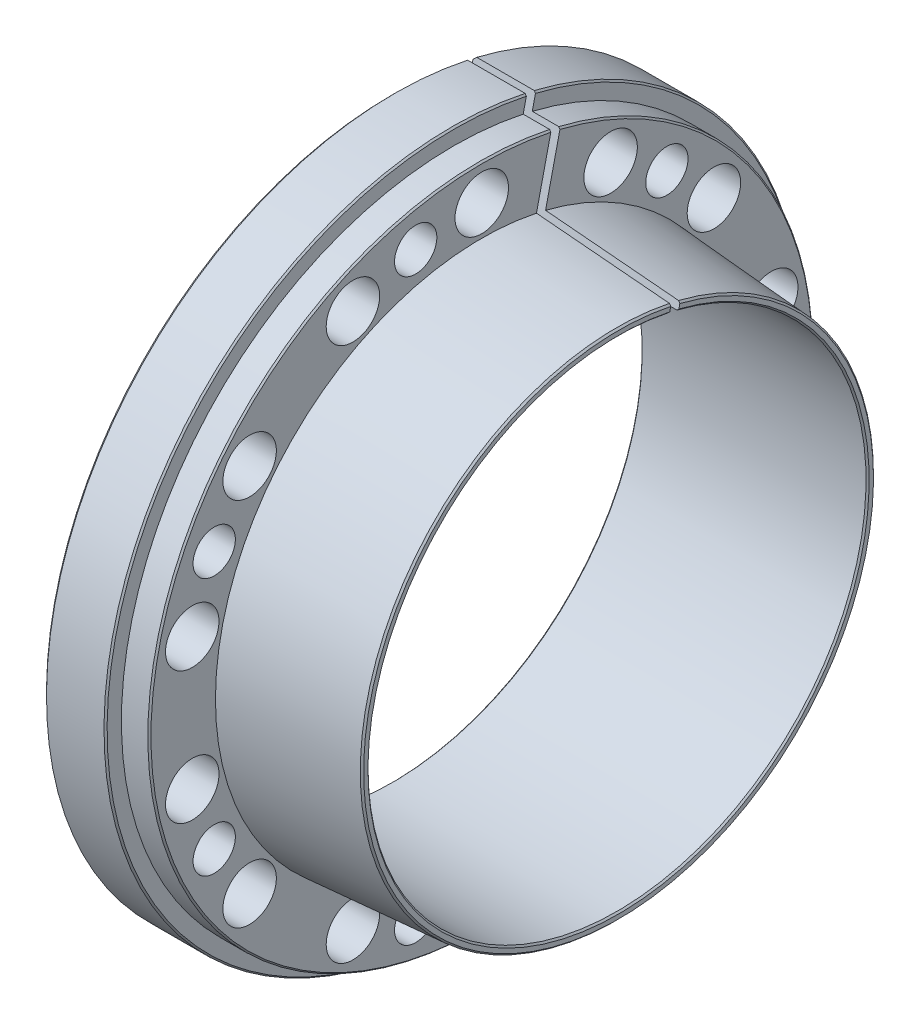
ISO-10303-21;
HEADER;
FILE_DESCRIPTION(('STEP AP214'),'2;1');
FILE_NAME('part.step','',(''),(''),'','','');
FILE_SCHEMA(('AUTOMOTIVE_DESIGN { 1 0 10303 214 1 1 1 1 }'));
ENDSEC;
DATA;
#1=APPLICATION_CONTEXT('core data for automotive mechanical design processes');
#2=APPLICATION_PROTOCOL_DEFINITION('international standard','automotive_design',2000,#1);
#3=PRODUCT_CONTEXT('',#1,'mechanical');
#4=PRODUCT('Part','Part','',(#3));
#5=PRODUCT_RELATED_PRODUCT_CATEGORY('part','',(#4));
#6=PRODUCT_DEFINITION_FORMATION('','',#4);
#7=PRODUCT_DEFINITION_CONTEXT('part definition',#1,'design');
#8=PRODUCT_DEFINITION('design','',#6,#7);
#9=PRODUCT_DEFINITION_SHAPE('','',#8);
#10=(LENGTH_UNIT() NAMED_UNIT(*) SI_UNIT(.MILLI.,.METRE.));
#11=(NAMED_UNIT(*) PLANE_ANGLE_UNIT() SI_UNIT($,.RADIAN.));
#12=(NAMED_UNIT(*) SI_UNIT($,.STERADIAN.) SOLID_ANGLE_UNIT());
#13=UNCERTAINTY_MEASURE_WITH_UNIT(LENGTH_MEASURE(1.E-05),#10,'distance_accuracy_value','');
#14=(GEOMETRIC_REPRESENTATION_CONTEXT(3) GLOBAL_UNCERTAINTY_ASSIGNED_CONTEXT((#13)) GLOBAL_UNIT_ASSIGNED_CONTEXT((#10,
#11,#12)) REPRESENTATION_CONTEXT('',''));
#15=CARTESIAN_POINT('',(0.,0.,0.));
#16=DIRECTION('',(0.,0.,1.));
#17=DIRECTION('',(1.,0.,0.));
#18=AXIS2_PLACEMENT_3D('',#15,#16,#17);
#19=CARTESIAN_POINT('',(0.,0.,0.));
#20=DIRECTION('',(-1.,0.,0.));
#21=DIRECTION('',(0.,0.,1.));
#22=AXIS2_PLACEMENT_3D('',#19,#20,#21);
#23=CYLINDRICAL_SURFACE('',#22,56.);
#24=CARTESIAN_POINT('',(9.75000000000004,0.,0.));
#25=DIRECTION('',(-1.,0.,0.));
#26=DIRECTION('',(0.,0.,1.));
#27=AXIS2_PLACEMENT_3D('',#24,#25,#26);
#28=CIRCLE('',#27,56.);
#29=CARTESIAN_POINT('',(9.75000000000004,54.4241856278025,-13.1912099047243));
#30=VERTEX_POINT('',#29);
#31=CARTESIAN_POINT('',(9.75000000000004,54.7579659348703,-11.7288177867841));
#32=VERTEX_POINT('',#31);
#33=EDGE_CURVE('E169',#30,#32,#28,.T.);
#34=ORIENTED_EDGE('',*,*,#33,.T.);
#35=DIRECTION('',(-1.,0.,0.));
#36=VECTOR('',#35,1.);
#37=CARTESIAN_POINT('',(0.,54.7579659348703,-11.7288177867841));
#38=LINE('',#37,#36);
#39=CARTESIAN_POINT('',(0.499999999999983,54.7579659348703,-11.7288177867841));
#40=VERTEX_POINT('',#39);
#41=EDGE_CURVE('E546',#32,#40,#38,.T.);
#42=ORIENTED_EDGE('',*,*,#41,.T.);
#43=CARTESIAN_POINT('',(0.49999999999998,0.,0.));
#44=DIRECTION('',(1.,0.,0.));
#45=DIRECTION('',(0.,0.,-1.));
#46=AXIS2_PLACEMENT_3D('',#43,#44,#45);
#47=CIRCLE('',#46,56.);
#48=CARTESIAN_POINT('',(0.49999999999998,54.4241856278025,-13.1912099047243));
#49=VERTEX_POINT('',#48);
#50=EDGE_CURVE('E184',#40,#49,#47,.T.);
#51=ORIENTED_EDGE('',*,*,#50,.T.);
#52=DIRECTION('',(-1.,0.,0.));
#53=VECTOR('',#52,1.);
#54=CARTESIAN_POINT('',(0.,54.4241856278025,-13.1912099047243));
#55=LINE('',#54,#53);
#56=EDGE_CURVE('E65',#30,#49,#55,.T.);
#57=ORIENTED_EDGE('',*,*,#56,.F.);
#58=EDGE_LOOP('',(#34,#42,#51,#57));
#59=FACE_BOUND('',#58,.T.);
#60=ADVANCED_FACE('F39',(#59),#23,.T.);
#61=CARTESIAN_POINT('',(0.,40.05,0.));
#62=DIRECTION('',(1.,0.,0.));
#63=DIRECTION('',(0.,0.,-1.));
#64=AXIS2_PLACEMENT_3D('',#61,#62,#63);
#65=PLANE('',#64);
#66=CARTESIAN_POINT('',(0.,46.5528157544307,10.6253397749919));
#67=DIRECTION('',(-1.,0.,0.));
#68=DIRECTION('',(0.,0.,1.));
#69=AXIS2_PLACEMENT_3D('',#66,#67,#68);
#70=CIRCLE('',#69,3.39999999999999);
#71=CARTESIAN_POINT('',(0.,46.5528157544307,14.0253397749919));
#72=VERTEX_POINT('',#71);
#73=EDGE_CURVE('E232',#72,#72,#70,.T.);
#74=ORIENTED_EDGE('',*,*,#73,.F.);
#75=EDGE_LOOP('',(#74));
#76=FACE_BOUND('',#75,.T.);
#77=CARTESIAN_POINT('',(0.,29.7716380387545,-37.3324532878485));
#78=DIRECTION('',(-1.,0.,0.));
#79=DIRECTION('',(0.,0.781831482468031,0.623489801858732));
#80=AXIS2_PLACEMENT_3D('',#77,#78,#79);
#81=CIRCLE('',#80,4.3);
#82=CARTESIAN_POINT('',(0.,33.133513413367,-34.6514471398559));
#83=VERTEX_POINT('',#82);
#84=EDGE_CURVE('E857',#83,#83,#81,.T.);
#85=ORIENTED_EDGE('',*,*,#84,.F.);
#86=EDGE_LOOP('',(#85));
#87=FACE_BOUND('',#86,.T.);
#88=CARTESIAN_POINT('',(0.,10.6253745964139,-46.5528078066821));
#89=DIRECTION('',(-1.,0.,0.));
#90=DIRECTION('',(0.,0.974927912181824,0.222520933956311));
#91=AXIS2_PLACEMENT_3D('',#88,#89,#90);
#92=CIRCLE('',#91,4.3);
#93=CARTESIAN_POINT('',(0.,14.8175646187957,-45.59596779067));
#94=VERTEX_POINT('',#93);
#95=EDGE_CURVE('E860',#94,#94,#92,.T.);
#96=ORIENTED_EDGE('',*,*,#95,.F.);
#97=EDGE_LOOP('',(#96));
#98=FACE_BOUND('',#97,.T.);
#99=CARTESIAN_POINT('',(0.,-10.6253745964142,-46.552807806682));
#100=DIRECTION('',(-1.,0.,0.));
#101=DIRECTION('',(0.,0.974927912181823,-0.222520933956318));
#102=AXIS2_PLACEMENT_3D('',#99,#100,#101);
#103=CIRCLE('',#102,4.3);
#104=CARTESIAN_POINT('',(0.,-6.43318457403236,-47.5096478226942));
#105=VERTEX_POINT('',#104);
#106=EDGE_CURVE('E863',#105,#105,#103,.T.);
#107=ORIENTED_EDGE('',*,*,#106,.F.);
#108=EDGE_LOOP('',(#107));
#109=FACE_BOUND('',#108,.T.);
#110=CARTESIAN_POINT('',(0.,-29.7716380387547,-37.3324532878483));
#111=DIRECTION('',(-1.,0.,0.));
#112=DIRECTION('',(0.,0.781831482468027,-0.623489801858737));
#113=AXIS2_PLACEMENT_3D('',#110,#111,#112);
#114=CIRCLE('',#113,4.3);
#115=CARTESIAN_POINT('',(0.,-26.4097626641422,-40.0134594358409));
#116=VERTEX_POINT('',#115);
#117=EDGE_CURVE('E866',#116,#116,#114,.T.);
#118=ORIENTED_EDGE('',*,*,#117,.F.);
#119=EDGE_LOOP('',(#118));
#120=FACE_BOUND('',#119,.T.);
#121=CARTESIAN_POINT('',(0.,-43.0212634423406,-20.7179485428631));
#122=DIRECTION('',(-1.,0.,0.));
#123=DIRECTION('',(0.,0.433883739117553,-0.900968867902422));
#124=AXIS2_PLACEMENT_3D('',#121,#122,#123);
#125=CIRCLE('',#124,4.3);
#126=CARTESIAN_POINT('',(0.,-41.1555633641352,-24.5921146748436));
#127=VERTEX_POINT('',#126);
#128=EDGE_CURVE('E869',#127,#127,#125,.T.);
#129=ORIENTED_EDGE('',*,*,#128,.F.);
#130=EDGE_LOOP('',(#129));
#131=FACE_BOUND('',#130,.T.);
#132=CARTESIAN_POINT('',(0.,-47.75,0.));
#133=DIRECTION('',(-1.,0.,0.));
#134=DIRECTION('',(0.,0.,-1.));
#135=AXIS2_PLACEMENT_3D('',#132,#133,#134);
#136=CIRCLE('',#135,4.3);
#137=CARTESIAN_POINT('',(0.,-47.75,-4.3));
#138=VERTEX_POINT('',#137);
#139=EDGE_CURVE('E872',#138,#138,#136,.T.);
#140=ORIENTED_EDGE('',*,*,#139,.F.);
#141=EDGE_LOOP('',(#140));
#142=FACE_BOUND('',#141,.T.);
#143=CARTESIAN_POINT('',(0.,-43.0212634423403,20.7179485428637));
#144=DIRECTION('',(-1.,0.,0.));
#145=DIRECTION('',(0.,-0.433883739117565,-0.900968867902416));
#146=AXIS2_PLACEMENT_3D('',#143,#144,#145);
#147=CIRCLE('',#146,4.3);
#148=CARTESIAN_POINT('',(0.,-44.8869635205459,16.8437824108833));
#149=VERTEX_POINT('',#148);
#150=EDGE_CURVE('E875',#149,#149,#147,.T.);
#151=ORIENTED_EDGE('',*,*,#150,.F.);
#152=EDGE_LOOP('',(#151));
#153=FACE_BOUND('',#152,.T.);
#154=CARTESIAN_POINT('',(0.,-29.7716380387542,37.3324532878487));
#155=DIRECTION('',(-1.,0.,0.));
#156=DIRECTION('',(0.,-0.781831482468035,-0.623489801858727));
#157=AXIS2_PLACEMENT_3D('',#154,#155,#156);
#158=CIRCLE('',#157,4.3);
#159=CARTESIAN_POINT('',(0.,-33.1335134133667,34.6514471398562));
#160=VERTEX_POINT('',#159);
#161=EDGE_CURVE('E878',#160,#160,#158,.T.);
#162=ORIENTED_EDGE('',*,*,#161,.F.);
#163=EDGE_LOOP('',(#162));
#164=FACE_BOUND('',#163,.T.);
#165=CARTESIAN_POINT('',(0.,-10.6253745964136,46.5528078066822));
#166=DIRECTION('',(-1.,0.,0.));
#167=DIRECTION('',(0.,-0.974927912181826,-0.222520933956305));
#168=AXIS2_PLACEMENT_3D('',#165,#166,#167);
#169=CIRCLE('',#168,4.3);
#170=CARTESIAN_POINT('',(0.,-14.8175646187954,45.5959677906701));
#171=VERTEX_POINT('',#170);
#172=EDGE_CURVE('E880',#171,#171,#169,.T.);
#173=ORIENTED_EDGE('',*,*,#172,.F.);
#174=EDGE_LOOP('',(#173));
#175=FACE_BOUND('',#174,.T.);
#176=CARTESIAN_POINT('',(0.,10.6253745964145,46.552807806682));
#177=DIRECTION('',(-1.,0.,0.));
#178=DIRECTION('',(0.,-0.974927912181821,0.222520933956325));
#179=AXIS2_PLACEMENT_3D('',#176,#177,#178);
#180=CIRCLE('',#179,4.3);
#181=CARTESIAN_POINT('',(0.,6.43318457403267,47.5096478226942));
#182=VERTEX_POINT('',#181);
#183=EDGE_CURVE('E853',#182,#182,#180,.T.);
#184=ORIENTED_EDGE('',*,*,#183,.F.);
#185=EDGE_LOOP('',(#184));
#186=FACE_BOUND('',#185,.T.);
#187=CARTESIAN_POINT('',(0.,29.771638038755,37.3324532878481));
#188=DIRECTION('',(-1.,0.,0.));
#189=DIRECTION('',(0.,-0.781831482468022,0.623489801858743));
#190=AXIS2_PLACEMENT_3D('',#187,#188,#189);
#191=CIRCLE('',#190,4.3);
#192=CARTESIAN_POINT('',(0.,26.4097626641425,40.0134594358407));
#193=VERTEX_POINT('',#192);
#194=EDGE_CURVE('E850',#193,#193,#191,.T.);
#195=ORIENTED_EDGE('',*,*,#194,.F.);
#196=EDGE_LOOP('',(#195));
#197=FACE_BOUND('',#196,.T.);
#198=CARTESIAN_POINT('',(0.,43.0212634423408,20.7179485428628));
#199=DIRECTION('',(-1.,0.,0.));
#200=DIRECTION('',(0.,-0.433883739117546,0.900968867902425));
#201=AXIS2_PLACEMENT_3D('',#198,#199,#200);
#202=CIRCLE('',#201,4.3);
#203=CARTESIAN_POINT('',(0.,41.1555633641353,24.5921146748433));
#204=VERTEX_POINT('',#203);
#205=EDGE_CURVE('E231',#204,#204,#202,.T.);
#206=ORIENTED_EDGE('',*,*,#205,.F.);
#207=EDGE_LOOP('',(#206));
#208=FACE_BOUND('',#207,.T.);
#209=CARTESIAN_POINT('',(0.,43.0212634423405,-20.7179485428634));
#210=DIRECTION('',(-1.,0.,0.));
#211=DIRECTION('',(0.,0.433883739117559,0.900968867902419));
#212=AXIS2_PLACEMENT_3D('',#209,#210,#211);
#213=CIRCLE('',#212,4.3);
#214=CARTESIAN_POINT('',(0.,44.886963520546,-16.843782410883));
#215=VERTEX_POINT('',#214);
#216=EDGE_CURVE('E192',#215,#215,#213,.T.);
#217=ORIENTED_EDGE('',*,*,#216,.F.);
#218=EDGE_LOOP('',(#217));
#219=FACE_BOUND('',#218,.T.);
#220=CARTESIAN_POINT('',(0.,47.75,0.));
#221=DIRECTION('',(-1.,0.,0.));
#222=DIRECTION('',(0.,0.,1.));
#223=AXIS2_PLACEMENT_3D('',#220,#221,#222);
#224=CIRCLE('',#223,4.3);
#225=CARTESIAN_POINT('',(0.,47.75,4.3));
#226=VERTEX_POINT('',#225);
#227=EDGE_CURVE('E155',#226,#226,#224,.T.);
#228=ORIENTED_EDGE('',*,*,#227,.F.);
#229=EDGE_LOOP('',(#228));
#230=FACE_BOUND('',#229,.T.);
#231=CARTESIAN_POINT('',(0.,0.,0.));
#232=DIRECTION('',(1.,0.,0.));
#233=DIRECTION('',(0.,0.,-1.));
#234=AXIS2_PLACEMENT_3D('',#231,#232,#233);
#235=CIRCLE('',#234,55.5);
#236=CARTESIAN_POINT('',(0.,53.936677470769,-13.0799397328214));
#237=VERTEX_POINT('',#236);
#238=CARTESIAN_POINT('',(0.,54.2704577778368,-11.6175476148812));
#239=VERTEX_POINT('',#238);
#240=EDGE_CURVE('E186',#237,#239,#235,.F.);
#241=ORIENTED_EDGE('',*,*,#240,.T.);
#242=DIRECTION('',(0.,-0.97492807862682,0.22252020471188));
#243=VECTOR('',#242,1.);
#244=CARTESIAN_POINT('',(0.,0.16689015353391,0.731196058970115));
#245=LINE('',#244,#243);
#246=CARTESIAN_POINT('',(0.,39.4496871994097,-8.23481510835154));
#247=VERTEX_POINT('',#246);
#248=EDGE_CURVE('E45',#247,#239,#245,.F.);
#249=ORIENTED_EDGE('',*,*,#248,.F.);
#250=CARTESIAN_POINT('',(0.,0.,0.));
#251=DIRECTION('',(1.,0.,0.));
#252=DIRECTION('',(0.,0.,-1.));
#253=AXIS2_PLACEMENT_3D('',#250,#251,#252);
#254=CIRCLE('',#253,40.3);
#255=CARTESIAN_POINT('',(0.,39.1159068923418,-9.69720722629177));
#256=VERTEX_POINT('',#255);
#257=EDGE_CURVE('E183',#247,#256,#254,.T.);
#258=ORIENTED_EDGE('',*,*,#257,.T.);
#259=DIRECTION('',(0.,-0.97492807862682,0.22252020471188));
#260=VECTOR('',#259,1.);
#261=CARTESIAN_POINT('',(0.,53.936677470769,-13.0799397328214));
#262=LINE('',#261,#260);
#263=EDGE_CURVE('E421',#256,#237,#262,.F.);
#264=ORIENTED_EDGE('',*,*,#263,.T.);
#265=EDGE_LOOP('',(#241,#249,#258,#264));
#266=FACE_BOUND('',#265,.T.);
#267=CARTESIAN_POINT('',(0.,37.3324681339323,-29.7716194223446));
#268=DIRECTION('',(-1.,0.,0.));
#269=DIRECTION('',(0.,0.,1.));
#270=AXIS2_PLACEMENT_3D('',#267,#268,#269);
#271=CIRCLE('',#270,3.39999999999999);
#272=CARTESIAN_POINT('',(0.,37.3324681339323,-26.3716194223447));
#273=VERTEX_POINT('',#272);
#274=EDGE_CURVE('E236',#273,#273,#271,.T.);
#275=ORIENTED_EDGE('',*,*,#274,.F.);
#276=EDGE_LOOP('',(#275));
#277=FACE_BOUND('',#276,.T.);
#278=CARTESIAN_POINT('',(0.,8.33394712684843E-05,-47.7499999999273));
#279=DIRECTION('',(-1.,0.,0.));
#280=DIRECTION('',(0.,0.,1.));
#281=AXIS2_PLACEMENT_3D('',#278,#279,#280);
#282=CIRCLE('',#281,3.4);
#283=CARTESIAN_POINT('',(0.,8.33394712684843E-05,-44.3499999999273));
#284=VERTEX_POINT('',#283);
#285=EDGE_CURVE('E240',#284,#284,#282,.T.);
#286=ORIENTED_EDGE('',*,*,#285,.F.);
#287=EDGE_LOOP('',(#286));
#288=FACE_BOUND('',#287,.T.);
#289=CARTESIAN_POINT('',(0.,-37.332364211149,-29.7717497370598));
#290=DIRECTION('',(-1.,0.,0.));
#291=DIRECTION('',(0.,0.,1.));
#292=AXIS2_PLACEMENT_3D('',#289,#290,#291);
#293=CIRCLE('',#292,3.39999999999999);
#294=CARTESIAN_POINT('',(0.,-37.332364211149,-26.3717497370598));
#295=VERTEX_POINT('',#294);
#296=EDGE_CURVE('E244',#295,#295,#293,.T.);
#297=ORIENTED_EDGE('',*,*,#296,.F.);
#298=EDGE_LOOP('',(#297));
#299=FACE_BOUND('',#298,.T.);
#300=CARTESIAN_POINT('',(0.,-46.5528528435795,10.625177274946));
#301=DIRECTION('',(-1.,0.,0.));
#302=DIRECTION('',(0.,0.,1.));
#303=AXIS2_PLACEMENT_3D('',#300,#301,#302);
#304=CIRCLE('',#303,3.39999999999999);
#305=CARTESIAN_POINT('',(0.,-46.5528528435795,14.025177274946));
#306=VERTEX_POINT('',#305);
#307=EDGE_CURVE('E248',#306,#306,#304,.T.);
#308=ORIENTED_EDGE('',*,*,#307,.F.);
#309=EDGE_LOOP('',(#308));
#310=FACE_BOUND('',#309,.T.);
#311=CARTESIAN_POINT('',(0.,-20.7181845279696,43.0211497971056));
#312=DIRECTION('',(-1.,0.,0.));
#313=DIRECTION('',(0.,0.,1.));
#314=AXIS2_PLACEMENT_3D('',#311,#312,#313);
#315=CIRCLE('',#314,3.4);
#316=CARTESIAN_POINT('',(0.,-20.7181845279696,46.4211497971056));
#317=VERTEX_POINT('',#316);
#318=EDGE_CURVE('E904',#317,#317,#315,.T.);
#319=ORIENTED_EDGE('',*,*,#318,.F.);
#320=EDGE_LOOP('',(#319));
#321=FACE_BOUND('',#320,.T.);
#322=CARTESIAN_POINT('',(0.,20.7176589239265,43.0214029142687));
#323=DIRECTION('',(-1.,0.,0.));
#324=DIRECTION('',(0.,0.,1.));
#325=AXIS2_PLACEMENT_3D('',#322,#323,#324);
#326=CIRCLE('',#325,3.4);
#327=CARTESIAN_POINT('',(0.,20.7176589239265,46.4214029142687));
#328=VERTEX_POINT('',#327);
#329=EDGE_CURVE('E339',#328,#328,#326,.T.);
#330=ORIENTED_EDGE('',*,*,#329,.F.);
#331=EDGE_LOOP('',(#330));
#332=FACE_BOUND('',#331,.T.);
#333=ADVANCED_FACE('F430',(#76,#87,#98,#109,#120,#131,#142,#153,#164,#175,#186,#197,#208,#219,
#230,#266,#277,#288,#299,#310,#321,#332),#65,.F.);
#334=CARTESIAN_POINT('',(10.,56.,0.));
#335=DIRECTION('',(-1.,0.,0.));
#336=DIRECTION('',(0.,0.,1.));
#337=AXIS2_PLACEMENT_3D('',#334,#335,#336);
#338=PLANE('',#337);
#339=CARTESIAN_POINT('',(10.,0.,0.));
#340=DIRECTION('',(-1.,0.,0.));
#341=DIRECTION('',(0.,0.,1.));
#342=AXIS2_PLACEMENT_3D('',#339,#340,#341);
#343=CIRCLE('',#342,53.45);
#344=CARTESIAN_POINT('',(10.,51.9378853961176,-12.6237300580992));
#345=VERTEX_POINT('',#344);
#346=CARTESIAN_POINT('',(10.,52.2716657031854,-11.1613379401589));
#347=VERTEX_POINT('',#346);
#348=EDGE_CURVE('E148',#345,#347,#343,.T.);
#349=ORIENTED_EDGE('',*,*,#348,.T.);
#350=DIRECTION('',(0.,0.97492807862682,-0.22252020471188));
#351=VECTOR('',#350,1.);
#352=CARTESIAN_POINT('',(10.,53.394036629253,-11.4175108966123));
#353=LINE('',#352,#351);
#354=CARTESIAN_POINT('',(10.,54.5142119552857,-11.6731827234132));
#355=VERTEX_POINT('',#354);
#356=EDGE_CURVE('E379',#347,#355,#353,.T.);
#357=ORIENTED_EDGE('',*,*,#356,.T.);
#358=CARTESIAN_POINT('',(10.,0.,0.));
#359=DIRECTION('',(-1.,0.,0.));
#360=DIRECTION('',(0.,0.,1.));
#361=AXIS2_PLACEMENT_3D('',#358,#359,#360);
#362=CIRCLE('',#361,55.75);
#363=CARTESIAN_POINT('',(10.,54.1804316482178,-13.1355748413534));
#364=VERTEX_POINT('',#363);
#365=EDGE_CURVE('E172',#355,#364,#362,.F.);
#366=ORIENTED_EDGE('',*,*,#365,.T.);
#367=DIRECTION('',(0.,0.97492807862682,-0.22252020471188));
#368=VECTOR('',#367,1.);
#369=CARTESIAN_POINT('',(10.,53.0602563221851,-12.8799030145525));
#370=LINE('',#369,#368);
#371=EDGE_CURVE('E405',#345,#364,#370,.T.);
#372=ORIENTED_EDGE('',*,*,#371,.F.);
#373=EDGE_LOOP('',(#349,#357,#366,#372));
#374=FACE_BOUND('',#373,.T.);
#375=ADVANCED_FACE('F402',(#374),#338,.F.);
#376=CARTESIAN_POINT('',(0.,0.,0.));
#377=DIRECTION('',(-1.,0.,0.));
#378=DIRECTION('',(0.,0.,1.));
#379=AXIS2_PLACEMENT_3D('',#376,#377,#378);
#380=CYLINDRICAL_SURFACE('',#379,53.45);
#381=CARTESIAN_POINT('',(14.25,0.,0.));
#382=DIRECTION('',(-1.,0.,0.));
#383=DIRECTION('',(0.,0.,1.));
#384=AXIS2_PLACEMENT_3D('',#381,#382,#383);
#385=CIRCLE('',#384,53.45);
#386=CARTESIAN_POINT('',(14.25,51.9378853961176,-12.6237300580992));
#387=VERTEX_POINT('',#386);
#388=CARTESIAN_POINT('',(14.25,52.2716657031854,-11.1613379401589));
#389=VERTEX_POINT('',#388);
#390=EDGE_CURVE('E175',#387,#389,#385,.T.);
#391=ORIENTED_EDGE('',*,*,#390,.T.);
#392=DIRECTION('',(-1.,0.,0.));
#393=VECTOR('',#392,1.);
#394=CARTESIAN_POINT('',(0.,52.2716657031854,-11.1613379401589));
#395=LINE('',#394,#393);
#396=EDGE_CURVE('E388',#389,#347,#395,.T.);
#397=ORIENTED_EDGE('',*,*,#396,.T.);
#398=ORIENTED_EDGE('',*,*,#348,.F.);
#399=DIRECTION('',(-1.,0.,0.));
#400=VECTOR('',#399,1.);
#401=CARTESIAN_POINT('',(0.,51.9378853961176,-12.6237300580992));
#402=LINE('',#401,#400);
#403=EDGE_CURVE('E414',#387,#345,#402,.T.);
#404=ORIENTED_EDGE('',*,*,#403,.F.);
#405=EDGE_LOOP('',(#391,#397,#398,#404));
#406=FACE_BOUND('',#405,.T.);
#407=ADVANCED_FACE('F396',(#406),#380,.T.);
#408=CARTESIAN_POINT('',(14.5,53.45,0.));
#409=DIRECTION('',(-1.,0.,0.));
#410=DIRECTION('',(0.,0.,1.));
#411=AXIS2_PLACEMENT_3D('',#408,#409,#410);
#412=PLANE('',#411);
#413=CARTESIAN_POINT('',(14.5,20.7176589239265,43.0214029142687));
#414=DIRECTION('',(-1.,0.,0.));
#415=DIRECTION('',(0.,0.,1.));
#416=AXIS2_PLACEMENT_3D('',#413,#414,#415);
#417=CIRCLE('',#416,3.39999999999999);
#418=CARTESIAN_POINT('',(14.5,20.7176589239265,46.4214029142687));
#419=VERTEX_POINT('',#418);
#420=EDGE_CURVE('E471',#419,#419,#417,.T.);
#421=ORIENTED_EDGE('',*,*,#420,.T.);
#422=EDGE_LOOP('',(#421));
#423=FACE_BOUND('',#422,.T.);
#424=CARTESIAN_POINT('',(14.5,-20.7181845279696,43.0211497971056));
#425=DIRECTION('',(-1.,0.,0.));
#426=DIRECTION('',(0.,0.,1.));
#427=AXIS2_PLACEMENT_3D('',#424,#425,#426);
#428=CIRCLE('',#427,3.39999999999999);
#429=CARTESIAN_POINT('',(14.5,-20.7181845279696,46.4211497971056));
#430=VERTEX_POINT('',#429);
#431=EDGE_CURVE('E475',#430,#430,#428,.T.);
#432=ORIENTED_EDGE('',*,*,#431,.T.);
#433=EDGE_LOOP('',(#432));
#434=FACE_BOUND('',#433,.T.);
#435=CARTESIAN_POINT('',(14.5,-46.5528528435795,10.625177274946));
#436=DIRECTION('',(-1.,0.,0.));
#437=DIRECTION('',(0.,0.,1.));
#438=AXIS2_PLACEMENT_3D('',#435,#436,#437);
#439=CIRCLE('',#438,3.39999999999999);
#440=CARTESIAN_POINT('',(14.5,-46.5528528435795,14.025177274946));
#441=VERTEX_POINT('',#440);
#442=EDGE_CURVE('E245',#441,#441,#439,.T.);
#443=ORIENTED_EDGE('',*,*,#442,.T.);
#444=EDGE_LOOP('',(#443));
#445=FACE_BOUND('',#444,.T.);
#446=CARTESIAN_POINT('',(14.5,-37.332364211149,-29.7717497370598));
#447=DIRECTION('',(-1.,0.,0.));
#448=DIRECTION('',(0.,0.,1.));
#449=AXIS2_PLACEMENT_3D('',#446,#447,#448);
#450=CIRCLE('',#449,3.39999999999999);
#451=CARTESIAN_POINT('',(14.5,-37.332364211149,-26.3717497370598));
#452=VERTEX_POINT('',#451);
#453=EDGE_CURVE('E241',#452,#452,#450,.T.);
#454=ORIENTED_EDGE('',*,*,#453,.T.);
#455=EDGE_LOOP('',(#454));
#456=FACE_BOUND('',#455,.T.);
#457=CARTESIAN_POINT('',(14.5,8.33394712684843E-05,-47.7499999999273));
#458=DIRECTION('',(-1.,0.,0.));
#459=DIRECTION('',(0.,0.,1.));
#460=AXIS2_PLACEMENT_3D('',#457,#458,#459);
#461=CIRCLE('',#460,3.39999999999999);
#462=CARTESIAN_POINT('',(14.5,8.33394712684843E-05,-44.3499999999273));
#463=VERTEX_POINT('',#462);
#464=EDGE_CURVE('E237',#463,#463,#461,.T.);
#465=ORIENTED_EDGE('',*,*,#464,.T.);
#466=EDGE_LOOP('',(#465));
#467=FACE_BOUND('',#466,.T.);
#468=CARTESIAN_POINT('',(14.5,37.3324681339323,-29.7716194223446));
#469=DIRECTION('',(-1.,0.,0.));
#470=DIRECTION('',(0.,0.,1.));
#471=AXIS2_PLACEMENT_3D('',#468,#469,#470);
#472=CIRCLE('',#471,3.39999999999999);
#473=CARTESIAN_POINT('',(14.5,37.3324681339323,-26.3716194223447));
#474=VERTEX_POINT('',#473);
#475=EDGE_CURVE('E233',#474,#474,#472,.T.);
#476=ORIENTED_EDGE('',*,*,#475,.T.);
#477=EDGE_LOOP('',(#476));
#478=FACE_BOUND('',#477,.T.);
#479=CARTESIAN_POINT('',(14.5,46.5528157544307,10.6253397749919));
#480=DIRECTION('',(-1.,0.,0.));
#481=DIRECTION('',(0.,0.,1.));
#482=AXIS2_PLACEMENT_3D('',#479,#480,#481);
#483=CIRCLE('',#482,3.39999999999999);
#484=CARTESIAN_POINT('',(14.5,46.5528157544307,14.0253397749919));
#485=VERTEX_POINT('',#484);
#486=EDGE_CURVE('E228',#485,#485,#483,.T.);
#487=ORIENTED_EDGE('',*,*,#486,.T.);
#488=EDGE_LOOP('',(#487));
#489=FACE_BOUND('',#488,.T.);
#490=CARTESIAN_POINT('',(14.5,29.7716380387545,-37.3324532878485));
#491=DIRECTION('',(-1.,0.,0.));
#492=DIRECTION('',(0.,0.,1.));
#493=AXIS2_PLACEMENT_3D('',#490,#491,#492);
#494=CIRCLE('',#493,4.3);
#495=CARTESIAN_POINT('',(14.5,29.7716380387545,-33.0324532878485));
#496=VERTEX_POINT('',#495);
#497=EDGE_CURVE('E225',#496,#496,#494,.T.);
#498=ORIENTED_EDGE('',*,*,#497,.T.);
#499=EDGE_LOOP('',(#498));
#500=FACE_BOUND('',#499,.T.);
#501=CARTESIAN_POINT('',(14.5,10.6253745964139,-46.5528078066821));
#502=DIRECTION('',(-1.,0.,0.));
#503=DIRECTION('',(0.,0.,1.));
#504=AXIS2_PLACEMENT_3D('',#501,#502,#503);
#505=CIRCLE('',#504,4.3);
#506=CARTESIAN_POINT('',(14.5,10.6253745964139,-42.2528078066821));
#507=VERTEX_POINT('',#506);
#508=EDGE_CURVE('E222',#507,#507,#505,.T.);
#509=ORIENTED_EDGE('',*,*,#508,.T.);
#510=EDGE_LOOP('',(#509));
#511=FACE_BOUND('',#510,.T.);
#512=CARTESIAN_POINT('',(14.5,-10.6253745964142,-46.552807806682));
#513=DIRECTION('',(-1.,0.,0.));
#514=DIRECTION('',(0.,0.,1.));
#515=AXIS2_PLACEMENT_3D('',#512,#513,#514);
#516=CIRCLE('',#515,4.3);
#517=CARTESIAN_POINT('',(14.5,-10.6253745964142,-42.252807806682));
#518=VERTEX_POINT('',#517);
#519=EDGE_CURVE('E219',#518,#518,#516,.T.);
#520=ORIENTED_EDGE('',*,*,#519,.T.);
#521=EDGE_LOOP('',(#520));
#522=FACE_BOUND('',#521,.T.);
#523=CARTESIAN_POINT('',(14.5,-29.7716380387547,-37.3324532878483));
#524=DIRECTION('',(-1.,0.,0.));
#525=DIRECTION('',(0.,0.,1.));
#526=AXIS2_PLACEMENT_3D('',#523,#524,#525);
#527=CIRCLE('',#526,4.3);
#528=CARTESIAN_POINT('',(14.5,-29.7716380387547,-33.0324532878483));
#529=VERTEX_POINT('',#528);
#530=EDGE_CURVE('E216',#529,#529,#527,.T.);
#531=ORIENTED_EDGE('',*,*,#530,.T.);
#532=EDGE_LOOP('',(#531));
#533=FACE_BOUND('',#532,.T.);
#534=CARTESIAN_POINT('',(14.5,-43.0212634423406,-20.7179485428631));
#535=DIRECTION('',(-1.,0.,0.));
#536=DIRECTION('',(0.,0.,1.));
#537=AXIS2_PLACEMENT_3D('',#534,#535,#536);
#538=CIRCLE('',#537,4.3);
#539=CARTESIAN_POINT('',(14.5,-43.0212634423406,-16.4179485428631));
#540=VERTEX_POINT('',#539);
#541=EDGE_CURVE('E213',#540,#540,#538,.T.);
#542=ORIENTED_EDGE('',*,*,#541,.T.);
#543=EDGE_LOOP('',(#542));
#544=FACE_BOUND('',#543,.T.);
#545=CARTESIAN_POINT('',(14.5,-47.75,0.));
#546=DIRECTION('',(-1.,0.,0.));
#547=DIRECTION('',(0.,0.,1.));
#548=AXIS2_PLACEMENT_3D('',#545,#546,#547);
#549=CIRCLE('',#548,4.3);
#550=CARTESIAN_POINT('',(14.5,-47.75,4.3));
#551=VERTEX_POINT('',#550);
#552=EDGE_CURVE('E210',#551,#551,#549,.T.);
#553=ORIENTED_EDGE('',*,*,#552,.T.);
#554=EDGE_LOOP('',(#553));
#555=FACE_BOUND('',#554,.T.);
#556=CARTESIAN_POINT('',(14.5,-43.0212634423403,20.7179485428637));
#557=DIRECTION('',(-1.,0.,0.));
#558=DIRECTION('',(0.,0.,1.));
#559=AXIS2_PLACEMENT_3D('',#556,#557,#558);
#560=CIRCLE('',#559,4.3);
#561=CARTESIAN_POINT('',(14.5,-43.0212634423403,25.0179485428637));
#562=VERTEX_POINT('',#561);
#563=EDGE_CURVE('E207',#562,#562,#560,.T.);
#564=ORIENTED_EDGE('',*,*,#563,.T.);
#565=EDGE_LOOP('',(#564));
#566=FACE_BOUND('',#565,.T.);
#567=CARTESIAN_POINT('',(14.5,-29.7716380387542,37.3324532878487));
#568=DIRECTION('',(-1.,0.,0.));
#569=DIRECTION('',(0.,0.,1.));
#570=AXIS2_PLACEMENT_3D('',#567,#568,#569);
#571=CIRCLE('',#570,4.3);
#572=CARTESIAN_POINT('',(14.5,-29.7716380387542,41.6324532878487));
#573=VERTEX_POINT('',#572);
#574=EDGE_CURVE('E204',#573,#573,#571,.T.);
#575=ORIENTED_EDGE('',*,*,#574,.T.);
#576=EDGE_LOOP('',(#575));
#577=FACE_BOUND('',#576,.T.);
#578=CARTESIAN_POINT('',(14.5,-10.6253745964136,46.5528078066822));
#579=DIRECTION('',(-1.,0.,0.));
#580=DIRECTION('',(0.,0.,1.));
#581=AXIS2_PLACEMENT_3D('',#578,#579,#580);
#582=CIRCLE('',#581,4.3);
#583=CARTESIAN_POINT('',(14.5,-10.6253745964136,50.8528078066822));
#584=VERTEX_POINT('',#583);
#585=EDGE_CURVE('E201',#584,#584,#582,.T.);
#586=ORIENTED_EDGE('',*,*,#585,.T.);
#587=EDGE_LOOP('',(#586));
#588=FACE_BOUND('',#587,.T.);
#589=CARTESIAN_POINT('',(14.5,10.6253745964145,46.552807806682));
#590=DIRECTION('',(-1.,0.,0.));
#591=DIRECTION('',(0.,0.,1.));
#592=AXIS2_PLACEMENT_3D('',#589,#590,#591);
#593=CIRCLE('',#592,4.3);
#594=CARTESIAN_POINT('',(14.5,10.6253745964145,50.852807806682));
#595=VERTEX_POINT('',#594);
#596=EDGE_CURVE('E198',#595,#595,#593,.T.);
#597=ORIENTED_EDGE('',*,*,#596,.T.);
#598=EDGE_LOOP('',(#597));
#599=FACE_BOUND('',#598,.T.);
#600=CARTESIAN_POINT('',(14.5,29.771638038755,37.3324532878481));
#601=DIRECTION('',(-1.,0.,0.));
#602=DIRECTION('',(0.,0.,1.));
#603=AXIS2_PLACEMENT_3D('',#600,#601,#602);
#604=CIRCLE('',#603,4.3);
#605=CARTESIAN_POINT('',(14.5,29.771638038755,41.6324532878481));
#606=VERTEX_POINT('',#605);
#607=EDGE_CURVE('E195',#606,#606,#604,.T.);
#608=ORIENTED_EDGE('',*,*,#607,.T.);
#609=EDGE_LOOP('',(#608));
#610=FACE_BOUND('',#609,.T.);
#611=CARTESIAN_POINT('',(14.5,43.0212634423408,20.7179485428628));
#612=DIRECTION('',(-1.,0.,0.));
#613=DIRECTION('',(0.,0.,1.));
#614=AXIS2_PLACEMENT_3D('',#611,#612,#613);
#615=CIRCLE('',#614,4.3);
#616=CARTESIAN_POINT('',(14.5,43.0212634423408,25.0179485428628));
#617=VERTEX_POINT('',#616);
#618=EDGE_CURVE('E191',#617,#617,#615,.T.);
#619=ORIENTED_EDGE('',*,*,#618,.T.);
#620=EDGE_LOOP('',(#619));
#621=FACE_BOUND('',#620,.T.);
#622=CARTESIAN_POINT('',(14.5,43.0212634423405,-20.7179485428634));
#623=DIRECTION('',(-1.,0.,0.));
#624=DIRECTION('',(0.,0.,1.));
#625=AXIS2_PLACEMENT_3D('',#622,#623,#624);
#626=CIRCLE('',#625,4.3);
#627=CARTESIAN_POINT('',(14.5,43.0212634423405,-16.4179485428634));
#628=VERTEX_POINT('',#627);
#629=EDGE_CURVE('E188',#628,#628,#626,.T.);
#630=ORIENTED_EDGE('',*,*,#629,.T.);
#631=EDGE_LOOP('',(#630));
#632=FACE_BOUND('',#631,.T.);
#633=CARTESIAN_POINT('',(14.5,47.75,0.));
#634=DIRECTION('',(-1.,0.,0.));
#635=DIRECTION('',(0.,0.,1.));
#636=AXIS2_PLACEMENT_3D('',#633,#634,#635);
#637=CIRCLE('',#636,4.3);
#638=CARTESIAN_POINT('',(14.5,47.75,4.3));
#639=VERTEX_POINT('',#638);
#640=EDGE_CURVE('E149',#639,#639,#637,.T.);
#641=ORIENTED_EDGE('',*,*,#640,.T.);
#642=EDGE_LOOP('',(#641));
#643=FACE_BOUND('',#642,.T.);
#644=CARTESIAN_POINT('',(14.5,0.,0.));
#645=DIRECTION('',(-1.,0.,0.));
#646=DIRECTION('',(0.,0.,1.));
#647=AXIS2_PLACEMENT_3D('',#644,#645,#646);
#648=CIRCLE('',#647,42.8275);
#649=CARTESIAN_POINT('',(14.5,41.5804392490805,-10.2597187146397));
#650=VERTEX_POINT('',#649);
#651=CARTESIAN_POINT('',(14.5,41.9142195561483,-8.79732659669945));
#652=VERTEX_POINT('',#651);
#653=EDGE_CURVE('E139',#650,#652,#648,.T.);
#654=ORIENTED_EDGE('',*,*,#653,.T.);
#655=DIRECTION('',(0.,0.97492807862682,-0.22252020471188));
#656=VECTOR('',#655,1.);
#657=CARTESIAN_POINT('',(14.5,50.9703004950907,-10.864310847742));
#658=LINE('',#657,#656);
#659=CARTESIAN_POINT('',(14.5,52.0279095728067,-11.105702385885));
#660=VERTEX_POINT('',#659);
#661=EDGE_CURVE('E123',#652,#660,#658,.T.);
#662=ORIENTED_EDGE('',*,*,#661,.T.);
#663=CARTESIAN_POINT('',(14.5,0.,0.));
#664=DIRECTION('',(-1.,0.,0.));
#665=DIRECTION('',(0.,0.,1.));
#666=AXIS2_PLACEMENT_3D('',#663,#664,#665);
#667=CIRCLE('',#666,53.2);
#668=CARTESIAN_POINT('',(14.5,51.6941292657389,-12.5680945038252));
#669=VERTEX_POINT('',#668);
#670=EDGE_CURVE('E178',#660,#669,#667,.F.);
#671=ORIENTED_EDGE('',*,*,#670,.T.);
#672=DIRECTION('',(0.,0.97492807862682,-0.22252020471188));
#673=VECTOR('',#672,1.);
#674=CARTESIAN_POINT('',(14.5,50.6365201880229,-12.3267029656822));
#675=LINE('',#674,#673);
#676=EDGE_CURVE('E147',#650,#669,#675,.T.);
#677=ORIENTED_EDGE('',*,*,#676,.F.);
#678=EDGE_LOOP('',(#654,#662,#671,#677));
#679=FACE_BOUND('',#678,.T.);
#680=ADVANCED_FACE('F145',(#423,#434,#445,#456,#467,#478,#489,#500,#511,#522,#533,#544,#555,
#566,#577,#588,#599,#610,#621,#632,#643,#679),#412,.F.);
#681=CARTESIAN_POINT('',(36.5,0.,0.));
#682=DIRECTION('',(-1.,0.,0.));
#683=DIRECTION('',(0.,0.,1.));
#684=AXIS2_PLACEMENT_3D('',#681,#682,#683);
#685=CONICAL_SURFACE('',#684,41.2505203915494,0.0715584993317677);
#686=CARTESIAN_POINT('',(36.2306960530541,0.,0.));
#687=DIRECTION('',(1.,0.,0.));
#688=DIRECTION('',(0.,0.,-1.));
#689=AXIS2_PLACEMENT_3D('',#686,#687,#688);
#690=CIRCLE('',#689,41.2698243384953);
#691=CARTESIAN_POINT('',(36.2306960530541,40.0615758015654,-9.91304923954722));
#692=VERTEX_POINT('',#691);
#693=CARTESIAN_POINT('',(36.2306960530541,40.3953561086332,-8.45065712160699));
#694=VERTEX_POINT('',#693);
#695=EDGE_CURVE('E141',#692,#694,#690,.F.);
#696=ORIENTED_EDGE('',*,*,#695,.T.);
#697=CARTESIAN_POINT('',(36.2308960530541,40.3953421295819,-8.45065393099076));
#698=CARTESIAN_POINT('',(32.6090468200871,40.6484921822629,-8.50843357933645));
#699=CARTESIAN_POINT('',(28.9871975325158,40.9016414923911,-8.56621305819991));
#700=CARTESIAN_POINT('',(21.7434988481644,41.4079386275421,-8.68177167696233));
#701=CARTESIAN_POINT('',(18.1216494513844,41.6610864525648,-8.7395508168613));
#702=CARTESIAN_POINT('',(14.4998,41.9142335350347,-8.79732978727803));
#703=B_SPLINE_CURVE_WITH_KNOTS('',3,(#697,#698,#699,#700,#701,#702),.UNSPECIFIED.,.F.,.F.,(4,2,
4),(0.,10.8934355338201,21.7868710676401),.UNSPECIFIED.);
#704=EDGE_CURVE('E126',#694,#652,#703,.T.);
#705=ORIENTED_EDGE('',*,*,#704,.T.);
#706=ORIENTED_EDGE('',*,*,#653,.F.);
#707=CARTESIAN_POINT('',(36.2308960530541,40.0615618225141,-9.91304604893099));
#708=CARTESIAN_POINT('',(32.6090468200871,40.3147118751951,-9.97082569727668));
#709=CARTESIAN_POINT('',(28.9871975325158,40.5678611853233,-10.0286051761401));
#710=CARTESIAN_POINT('',(21.7434988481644,41.0741583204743,-10.1441637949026));
#711=CARTESIAN_POINT('',(18.1216494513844,41.3273061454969,-10.2019429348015));
#712=CARTESIAN_POINT('',(14.4998,41.5804532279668,-10.2597219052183));
#713=B_SPLINE_CURVE_WITH_KNOTS('',3,(#707,#708,#709,#710,#711,#712),.UNSPECIFIED.,.F.,.F.,(4,2,
4),(0.,10.8934355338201,21.7868710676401),.UNSPECIFIED.);
#714=EDGE_CURVE('E308',#692,#650,#713,.T.);
#715=ORIENTED_EDGE('',*,*,#714,.F.);
#716=EDGE_LOOP('',(#696,#705,#706,#715));
#717=FACE_BOUND('',#716,.T.);
#718=ADVANCED_FACE('F138',(#717),#685,.T.);
#719=CARTESIAN_POINT('',(36.5,41.2505203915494,0.));
#720=DIRECTION('',(-1.,0.,0.));
#721=DIRECTION('',(0.,0.,1.));
#722=AXIS2_PLACEMENT_3D('',#719,#720,#721);
#723=PLANE('',#722);
#724=CARTESIAN_POINT('',(36.5,0.,0.));
#725=DIRECTION('',(-1.,0.,0.));
#726=DIRECTION('',(0.,0.,1.));
#727=AXIS2_PLACEMENT_3D('',#724,#725,#726);
#728=CIRCLE('',#727,40.3);
#729=CARTESIAN_POINT('',(36.5,39.1159068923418,-9.69720722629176));
#730=VERTEX_POINT('',#729);
#731=CARTESIAN_POINT('',(36.5,39.4496871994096,-8.23481510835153));
#732=VERTEX_POINT('',#731);
#733=EDGE_CURVE('E162',#730,#732,#728,.T.);
#734=ORIENTED_EDGE('',*,*,#733,.T.);
#735=DIRECTION('',(0.,0.97492807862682,-0.22252020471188));
#736=VECTOR('',#735,1.);
#737=CARTESIAN_POINT('',(36.5,0.16689015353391,0.731196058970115));
#738=LINE('',#737,#736);
#739=CARTESIAN_POINT('',(36.5,40.1327604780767,-8.39072158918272));
#740=VERTEX_POINT('',#739);
#741=EDGE_CURVE('E541',#732,#740,#738,.T.);
#742=ORIENTED_EDGE('',*,*,#741,.T.);
#743=CARTESIAN_POINT('',(36.5,0.,0.));
#744=DIRECTION('',(-1.,0.,0.));
#745=DIRECTION('',(0.,0.,1.));
#746=AXIS2_PLACEMENT_3D('',#743,#744,#745);
#747=CIRCLE('',#746,41.0005203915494);
#748=CARTESIAN_POINT('',(36.5,39.7989801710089,-9.85311370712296));
#749=VERTEX_POINT('',#748);
#750=EDGE_CURVE('E152',#740,#749,#747,.F.);
#751=ORIENTED_EDGE('',*,*,#750,.T.);
#752=DIRECTION('',(0.,0.97492807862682,-0.22252020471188));
#753=VECTOR('',#752,1.);
#754=CARTESIAN_POINT('',(36.5,-0.16689015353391,-0.731196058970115));
#755=LINE('',#754,#753);
#756=EDGE_CURVE('E429',#730,#749,#755,.T.);
#757=ORIENTED_EDGE('',*,*,#756,.F.);
#758=EDGE_LOOP('',(#734,#742,#751,#757));
#759=FACE_BOUND('',#758,.T.);
#760=ADVANCED_FACE('F324',(#759),#723,.F.);
#761=CARTESIAN_POINT('',(0.,0.,0.));
#762=DIRECTION('',(-1.,0.,0.));
#763=DIRECTION('',(0.,0.,1.));
#764=AXIS2_PLACEMENT_3D('',#761,#762,#763);
#765=CYLINDRICAL_SURFACE('',#764,40.05);
#766=CARTESIAN_POINT('',(0.250000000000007,0.,0.));
#767=DIRECTION('',(1.,0.,0.));
#768=DIRECTION('',(0.,0.,-1.));
#769=AXIS2_PLACEMENT_3D('',#766,#767,#768);
#770=CIRCLE('',#769,40.05);
#771=CARTESIAN_POINT('',(0.250000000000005,38.8721323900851,-9.64156747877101));
#772=VERTEX_POINT('',#771);
#773=CARTESIAN_POINT('',(0.250000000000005,39.2059126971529,-8.17917536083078));
#774=VERTEX_POINT('',#773);
#775=EDGE_CURVE('E180',#772,#774,#770,.F.);
#776=ORIENTED_EDGE('',*,*,#775,.T.);
#777=DIRECTION('',(-1.,0.,0.));
#778=VECTOR('',#777,1.);
#779=CARTESIAN_POINT('',(0.,39.2059126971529,-8.17917536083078));
#780=LINE('',#779,#778);
#781=CARTESIAN_POINT('',(36.25,39.2059126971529,-8.17917536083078));
#782=VERTEX_POINT('',#781);
#783=EDGE_CURVE('E372',#774,#782,#780,.F.);
#784=ORIENTED_EDGE('',*,*,#783,.T.);
#785=CARTESIAN_POINT('',(36.25,0.,0.));
#786=DIRECTION('',(-1.,0.,0.));
#787=DIRECTION('',(0.,0.,1.));
#788=AXIS2_PLACEMENT_3D('',#785,#786,#787);
#789=CIRCLE('',#788,40.05);
#790=CARTESIAN_POINT('',(36.25,38.8721323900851,-9.64156747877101));
#791=VERTEX_POINT('',#790);
#792=EDGE_CURVE('E165',#782,#791,#789,.F.);
#793=ORIENTED_EDGE('',*,*,#792,.T.);
#794=DIRECTION('',(-1.,0.,0.));
#795=VECTOR('',#794,1.);
#796=CARTESIAN_POINT('',(0.,38.8721323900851,-9.64156747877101));
#797=LINE('',#796,#795);
#798=EDGE_CURVE('E412',#772,#791,#797,.F.);
#799=ORIENTED_EDGE('',*,*,#798,.F.);
#800=EDGE_LOOP('',(#776,#784,#793,#799));
#801=FACE_BOUND('',#800,.T.);
#802=ADVANCED_FACE('F435',(#801),#765,.F.);
#803=CARTESIAN_POINT('',(36.5,0.,0.));
#804=DIRECTION('',(1.,0.,0.));
#805=DIRECTION('',(0.,0.,-1.));
#806=AXIS2_PLACEMENT_3D('',#803,#804,#805);
#807=CONICAL_SURFACE('',#806,40.3,0.785398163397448);
#808=CARTESIAN_POINT('',(36.5002,39.4498822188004,-8.23485962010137));
#809=CARTESIAN_POINT('',(36.4584666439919,39.4091881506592,-8.22557149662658));
#810=CARTESIAN_POINT('',(36.4167332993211,39.3684940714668,-8.21628337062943));
#811=CARTESIAN_POINT('',(36.3332666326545,39.2871058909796,-8.1977071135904));
#812=CARTESIAN_POINT('',(36.2915333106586,39.2464117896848,-8.18841898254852));
#813=CARTESIAN_POINT('',(36.2498,39.2057176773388,-8.17913084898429));
#814=B_SPLINE_CURVE_WITH_KNOTS('',3,(#808,#809,#810,#811,#812,#813),.UNSPECIFIED.,.F.,.F.,(4,2,
4),(0.,0.177074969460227,0.354149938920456),.UNSPECIFIED.);
#815=EDGE_CURVE('E382',#732,#782,#814,.T.);
#816=ORIENTED_EDGE('',*,*,#815,.F.);
#817=ORIENTED_EDGE('',*,*,#733,.F.);
#818=CARTESIAN_POINT('',(36.5002,39.1161019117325,-9.6972517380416));
#819=CARTESIAN_POINT('',(36.4584666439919,39.0754078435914,-9.68796361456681));
#820=CARTESIAN_POINT('',(36.4167332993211,39.034713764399,-9.67867548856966));
#821=CARTESIAN_POINT('',(36.3332666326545,38.9533255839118,-9.66009923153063));
#822=CARTESIAN_POINT('',(36.2915333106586,38.912631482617,-9.65081110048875));
#823=CARTESIAN_POINT('',(36.2498,38.8719373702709,-9.64152296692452));
#824=B_SPLINE_CURVE_WITH_KNOTS('',3,(#818,#819,#820,#821,#822,#823),.UNSPECIFIED.,.F.,.F.,(4,2,
4),(0.,0.177074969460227,0.354149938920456),.UNSPECIFIED.);
#825=EDGE_CURVE('E291',#730,#791,#824,.T.);
#826=ORIENTED_EDGE('',*,*,#825,.T.);
#827=ORIENTED_EDGE('',*,*,#792,.F.);
#828=EDGE_LOOP('',(#816,#817,#826,#827));
#829=FACE_BOUND('',#828,.T.);
#830=ADVANCED_FACE('F350',(#829),#807,.F.);
#831=CARTESIAN_POINT('',(36.2306960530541,0.,0.));
#832=DIRECTION('',(-1.,0.,0.));
#833=DIRECTION('',(0.,0.,1.));
#834=AXIS2_PLACEMENT_3D('',#831,#832,#833);
#835=CONICAL_SURFACE('',#834,41.2698243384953,0.78539816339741);
#836=CARTESIAN_POINT('',(36.2304960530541,40.3955511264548,-8.4507016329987));
#837=CARTESIAN_POINT('',(36.2754467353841,40.3517202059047,-8.44069754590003));
#838=CARTESIAN_POINT('',(36.3203974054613,40.307889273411,-8.43069345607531));
#839=CARTESIAN_POINT('',(36.4102987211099,40.2202273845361,-8.41068527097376));
#840=CARTESIAN_POINT('',(36.4552493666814,40.176396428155,-8.40068117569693));
#841=CARTESIAN_POINT('',(36.5002,40.1325654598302,-8.39067707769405));
#842=B_SPLINE_CURVE_WITH_KNOTS('',3,(#836,#837,#838,#839,#840,#841),.UNSPECIFIED.,.F.,.F.,(4,2,
4),(0.,0.190725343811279,0.381450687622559),.UNSPECIFIED.);
#843=EDGE_CURVE('E142',#694,#740,#842,.T.);
#844=ORIENTED_EDGE('',*,*,#843,.F.);
#845=ORIENTED_EDGE('',*,*,#695,.F.);
#846=CARTESIAN_POINT('',(36.2304960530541,40.061770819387,-9.91309375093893));
#847=CARTESIAN_POINT('',(36.2754467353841,40.0179398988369,-9.90308966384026));
#848=CARTESIAN_POINT('',(36.3203974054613,39.9741089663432,-9.89308557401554));
#849=CARTESIAN_POINT('',(36.4102987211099,39.8864470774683,-9.87307738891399));
#850=CARTESIAN_POINT('',(36.4552493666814,39.8426161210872,-9.86307329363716));
#851=CARTESIAN_POINT('',(36.5002,39.7987851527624,-9.85306919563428));
#852=B_SPLINE_CURVE_WITH_KNOTS('',3,(#846,#847,#848,#849,#850,#851),.UNSPECIFIED.,.F.,.F.,(4,2,
4),(0.,0.190725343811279,0.381450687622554),.UNSPECIFIED.);
#853=EDGE_CURVE('E92',#692,#749,#852,.T.);
#854=ORIENTED_EDGE('',*,*,#853,.T.);
#855=ORIENTED_EDGE('',*,*,#750,.F.);
#856=EDGE_LOOP('',(#844,#845,#854,#855));
#857=FACE_BOUND('',#856,.T.);
#858=ADVANCED_FACE('F342',(#857),#835,.T.);
#859=CARTESIAN_POINT('',(9.75000000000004,0.,0.));
#860=DIRECTION('',(-1.,0.,0.));
#861=DIRECTION('',(0.,0.,1.));
#862=AXIS2_PLACEMENT_3D('',#859,#860,#861);
#863=CONICAL_SURFACE('',#862,56.,0.78539816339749);
#864=CARTESIAN_POINT('',(9.74980000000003,54.7581609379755,-11.7288622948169));
#865=CARTESIAN_POINT('',(9.79153334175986,54.7174702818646,-11.719574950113));
#866=CARTESIAN_POINT('',(9.83326667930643,54.6767796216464,-11.7102876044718));
#867=CARTESIAN_POINT('',(9.91673334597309,54.5953982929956,-11.6917129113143));
#868=CARTESIAN_POINT('',(9.95846667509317,54.554707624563,-11.6824255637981));
#869=CARTESIAN_POINT('',(10.0002,54.5140169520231,-11.6731382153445));
#870=B_SPLINE_CURVE_WITH_KNOTS('',3,(#864,#865,#866,#867,#868,#869),.UNSPECIFIED.,.F.,.F.,(4,2,
4),(0.,0.17706751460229,0.354135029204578),.UNSPECIFIED.);
#871=EDGE_CURVE('E365',#32,#355,#870,.T.);
#872=ORIENTED_EDGE('',*,*,#871,.F.);
#873=ORIENTED_EDGE('',*,*,#33,.F.);
#874=CARTESIAN_POINT('',(9.74980000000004,54.4243806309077,-13.1912544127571));
#875=CARTESIAN_POINT('',(9.79153334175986,54.3836899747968,-13.1819670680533));
#876=CARTESIAN_POINT('',(9.83326667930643,54.3429993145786,-13.172679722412));
#877=CARTESIAN_POINT('',(9.91673334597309,54.2616179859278,-13.1541050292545));
#878=CARTESIAN_POINT('',(9.95846667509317,54.2209273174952,-13.1448176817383));
#879=CARTESIAN_POINT('',(10.0002,54.1802366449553,-13.1355303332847));
#880=B_SPLINE_CURVE_WITH_KNOTS('',3,(#874,#875,#876,#877,#878,#879),.UNSPECIFIED.,.F.,.F.,(4,2,
4),(0.,0.177067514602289,0.354135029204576),.UNSPECIFIED.);
#881=EDGE_CURVE('E282',#30,#364,#880,.T.);
#882=ORIENTED_EDGE('',*,*,#881,.T.);
#883=ORIENTED_EDGE('',*,*,#365,.F.);
#884=EDGE_LOOP('',(#872,#873,#882,#883));
#885=FACE_BOUND('',#884,.T.);
#886=ADVANCED_FACE('F349',(#885),#863,.T.);
#887=CARTESIAN_POINT('',(14.25,0.,0.));
#888=DIRECTION('',(-1.,0.,0.));
#889=DIRECTION('',(0.,0.,1.));
#890=AXIS2_PLACEMENT_3D('',#887,#888,#889);
#891=CONICAL_SURFACE('',#890,53.45,0.785398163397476);
#892=CARTESIAN_POINT('',(14.2498,52.2718607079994,-11.1613824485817));
#893=CARTESIAN_POINT('',(14.2915333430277,52.2311696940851,-11.1520950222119));
#894=CARTESIAN_POINT('',(14.3332666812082,52.1904786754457,-11.1428075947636));
#895=CARTESIAN_POINT('',(14.4167333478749,52.1090966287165,-11.1242327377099));
#896=CARTESIAN_POINT('',(14.458466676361,52.0684056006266,-11.1149453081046));
#897=CARTESIAN_POINT('',(14.5002,52.0277145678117,-11.1056578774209));
#898=B_SPLINE_CURVE_WITH_KNOTS('',3,(#892,#893,#894,#895,#896,#897),.UNSPECIFIED.,.F.,.F.,(4,2,
4),(0.,0.177068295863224,0.354136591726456),.UNSPECIFIED.);
#899=EDGE_CURVE('E129',#389,#660,#898,.T.);
#900=ORIENTED_EDGE('',*,*,#899,.F.);
#901=ORIENTED_EDGE('',*,*,#390,.F.);
#902=CARTESIAN_POINT('',(14.2498,51.9380804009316,-12.623774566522));
#903=CARTESIAN_POINT('',(14.2915333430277,51.8973893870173,-12.6144871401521));
#904=CARTESIAN_POINT('',(14.3332666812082,51.8566983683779,-12.6051997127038));
#905=CARTESIAN_POINT('',(14.4167333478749,51.7753163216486,-12.5866248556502));
#906=CARTESIAN_POINT('',(14.458466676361,51.7346252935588,-12.5773374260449));
#907=CARTESIAN_POINT('',(14.5002,51.6939342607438,-12.5680499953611));
#908=B_SPLINE_CURVE_WITH_KNOTS('',3,(#902,#903,#904,#905,#906,#907),.UNSPECIFIED.,.F.,.F.,(4,2,
4),(0.,0.177068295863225,0.354136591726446),.UNSPECIFIED.);
#909=EDGE_CURVE('E300',#387,#669,#908,.T.);
#910=ORIENTED_EDGE('',*,*,#909,.T.);
#911=ORIENTED_EDGE('',*,*,#670,.F.);
#912=EDGE_LOOP('',(#900,#901,#910,#911));
#913=FACE_BOUND('',#912,.T.);
#914=ADVANCED_FACE('F360',(#913),#891,.T.);
#915=CARTESIAN_POINT('',(0.250000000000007,0.,0.));
#916=DIRECTION('',(-1.,0.,0.));
#917=DIRECTION('',(0.,0.,1.));
#918=AXIS2_PLACEMENT_3D('',#915,#916,#917);
#919=CONICAL_SURFACE('',#918,40.05,0.785398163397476);
#920=CARTESIAN_POINT('',(0.250200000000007,39.2057176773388,-8.17913084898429));
#921=CARTESIAN_POINT('',(0.208466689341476,39.2464117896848,-8.18841898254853));
#922=CARTESIAN_POINT('',(0.166733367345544,39.2871058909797,-8.1977071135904));
#923=CARTESIAN_POINT('',(0.0832667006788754,39.3684940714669,-8.21628337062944));
#924=CARTESIAN_POINT('',(0.0415333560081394,39.4091881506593,-8.22557149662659));
#925=CARTESIAN_POINT('',(-0.000199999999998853,39.4498822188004,-8.23485962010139));
#926=B_SPLINE_CURVE_WITH_KNOTS('',3,(#920,#921,#922,#923,#924,#925),.UNSPECIFIED.,.F.,.F.,(4,2,
4),(0.,0.177074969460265,0.354149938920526),.UNSPECIFIED.);
#927=EDGE_CURVE('E82',#774,#247,#926,.T.);
#928=ORIENTED_EDGE('',*,*,#927,.F.);
#929=ORIENTED_EDGE('',*,*,#775,.F.);
#930=CARTESIAN_POINT('',(0.250200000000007,38.8719373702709,-9.64152296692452));
#931=CARTESIAN_POINT('',(0.208466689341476,38.912631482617,-9.65081110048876));
#932=CARTESIAN_POINT('',(0.166733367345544,38.9533255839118,-9.66009923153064));
#933=CARTESIAN_POINT('',(0.0832667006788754,39.0347137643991,-9.67867548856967));
#934=CARTESIAN_POINT('',(0.0415333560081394,39.0754078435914,-9.68796361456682));
#935=CARTESIAN_POINT('',(-0.000199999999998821,39.1161019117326,-9.69725173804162));
#936=B_SPLINE_CURVE_WITH_KNOTS('',3,(#930,#931,#932,#933,#934,#935),.UNSPECIFIED.,.F.,.F.,(4,2,
4),(0.,0.177074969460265,0.354149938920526),.UNSPECIFIED.);
#937=EDGE_CURVE('E274',#772,#256,#936,.T.);
#938=ORIENTED_EDGE('',*,*,#937,.T.);
#939=ORIENTED_EDGE('',*,*,#257,.F.);
#940=EDGE_LOOP('',(#928,#929,#938,#939));
#941=FACE_BOUND('',#940,.T.);
#942=ADVANCED_FACE('F432',(#941),#919,.F.);
#943=CARTESIAN_POINT('',(0.,0.,0.));
#944=DIRECTION('',(1.,0.,0.));
#945=DIRECTION('',(0.,0.,-1.));
#946=AXIS2_PLACEMENT_3D('',#943,#944,#945);
#947=CONICAL_SURFACE('',#946,55.5,0.785398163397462);
#948=CARTESIAN_POINT('',(-0.000199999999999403,54.2702627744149,-11.6175031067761));
#949=CARTESIAN_POINT('',(0.0831999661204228,54.3515791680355,-11.6360629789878));
#950=CARTESIAN_POINT('',(0.166599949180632,54.4328955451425,-11.6546228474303));
#951=CARTESIAN_POINT('',(0.333399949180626,54.5955282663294,-11.6917425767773));
#952=CARTESIAN_POINT('',(0.416799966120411,54.6768446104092,-11.7103024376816));
#953=CARTESIAN_POINT('',(0.500199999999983,54.7581609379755,-11.7288622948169));
#954=B_SPLINE_CURVE_WITH_KNOTS('',3,(#948,#949,#950,#951,#952,#953),.UNSPECIFIED.,.F.,.F.,(4,2,
4),(0.,0.353852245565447,0.7077044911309),.UNSPECIFIED.);
#955=EDGE_CURVE('E11',#239,#40,#954,.T.);
#956=ORIENTED_EDGE('',*,*,#955,.F.);
#957=ORIENTED_EDGE('',*,*,#240,.F.);
#958=CARTESIAN_POINT('',(-0.000199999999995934,53.9364824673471,-13.0798952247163));
#959=CARTESIAN_POINT('',(0.0831999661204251,54.0177988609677,-13.098455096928));
#960=CARTESIAN_POINT('',(0.166599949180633,54.0991152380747,-13.1170149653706));
#961=CARTESIAN_POINT('',(0.333399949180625,54.2617479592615,-13.1541346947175));
#962=CARTESIAN_POINT('',(0.416799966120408,54.3430643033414,-13.1726945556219));
#963=CARTESIAN_POINT('',(0.500199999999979,54.4243806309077,-13.1912544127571));
#964=B_SPLINE_CURVE_WITH_KNOTS('',3,(#958,#959,#960,#961,#962,#963),.UNSPECIFIED.,.F.,.F.,(4,2,
4),(0.,0.353852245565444,0.707704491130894),.UNSPECIFIED.);
#965=EDGE_CURVE('E50',#237,#49,#964,.T.);
#966=ORIENTED_EDGE('',*,*,#965,.T.);
#967=ORIENTED_EDGE('',*,*,#50,.F.);
#968=EDGE_LOOP('',(#956,#957,#966,#967));
#969=FACE_BOUND('',#968,.T.);
#970=ADVANCED_FACE('F42',(#969),#947,.T.);
#971=CARTESIAN_POINT('',(36.5,47.75,0.));
#972=DIRECTION('',(-1.,0.,0.));
#973=DIRECTION('',(0.,0.,1.));
#974=AXIS2_PLACEMENT_3D('',#971,#972,#973);
#975=CYLINDRICAL_SURFACE('',#974,4.3);
#976=ORIENTED_EDGE('',*,*,#227,.T.);
#977=EDGE_LOOP('',(#976));
#978=FACE_BOUND('',#977,.T.);
#979=ORIENTED_EDGE('',*,*,#640,.F.);
#980=EDGE_LOOP('',(#979));
#981=FACE_BOUND('',#980,.T.);
#982=ADVANCED_FACE('F514',(#978,#981),#975,.F.);
#983=CARTESIAN_POINT('',(36.5,43.0212634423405,-20.7179485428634));
#984=DIRECTION('',(-1.,0.,0.));
#985=DIRECTION('',(0.,0.,1.));
#986=AXIS2_PLACEMENT_3D('',#983,#984,#985);
#987=CYLINDRICAL_SURFACE('',#986,4.3);
#988=ORIENTED_EDGE('',*,*,#216,.T.);
#989=EDGE_LOOP('',(#988));
#990=FACE_BOUND('',#989,.T.);
#991=ORIENTED_EDGE('',*,*,#629,.F.);
#992=EDGE_LOOP('',(#991));
#993=FACE_BOUND('',#992,.T.);
#994=ADVANCED_FACE('F516',(#990,#993),#987,.F.);
#995=CARTESIAN_POINT('',(36.5,43.0212634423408,20.7179485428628));
#996=DIRECTION('',(-1.,0.,0.));
#997=DIRECTION('',(0.,0.,1.));
#998=AXIS2_PLACEMENT_3D('',#995,#996,#997);
#999=CYLINDRICAL_SURFACE('',#998,4.3);
#1000=ORIENTED_EDGE('',*,*,#205,.T.);
#1001=EDGE_LOOP('',(#1000));
#1002=FACE_BOUND('',#1001,.T.);
#1003=ORIENTED_EDGE('',*,*,#618,.F.);
#1004=EDGE_LOOP('',(#1003));
#1005=FACE_BOUND('',#1004,.T.);
#1006=ADVANCED_FACE('F523',(#1002,#1005),#999,.F.);
#1007=CARTESIAN_POINT('',(36.5,29.771638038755,37.3324532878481));
#1008=DIRECTION('',(-1.,0.,0.));
#1009=DIRECTION('',(0.,0.,1.));
#1010=AXIS2_PLACEMENT_3D('',#1007,#1008,#1009);
#1011=CYLINDRICAL_SURFACE('',#1010,4.3);
#1012=ORIENTED_EDGE('',*,*,#194,.T.);
#1013=EDGE_LOOP('',(#1012));
#1014=FACE_BOUND('',#1013,.T.);
#1015=ORIENTED_EDGE('',*,*,#607,.F.);
#1016=EDGE_LOOP('',(#1015));
#1017=FACE_BOUND('',#1016,.T.);
#1018=ADVANCED_FACE('F754',(#1014,#1017),#1011,.F.);
#1019=CARTESIAN_POINT('',(36.5,10.6253745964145,46.552807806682));
#1020=DIRECTION('',(-1.,0.,0.));
#1021=DIRECTION('',(0.,0.,1.));
#1022=AXIS2_PLACEMENT_3D('',#1019,#1020,#1021);
#1023=CYLINDRICAL_SURFACE('',#1022,4.3);
#1024=ORIENTED_EDGE('',*,*,#183,.T.);
#1025=EDGE_LOOP('',(#1024));
#1026=FACE_BOUND('',#1025,.T.);
#1027=ORIENTED_EDGE('',*,*,#596,.F.);
#1028=EDGE_LOOP('',(#1027));
#1029=FACE_BOUND('',#1028,.T.);
#1030=ADVANCED_FACE('F744',(#1026,#1029),#1023,.F.);
#1031=CARTESIAN_POINT('',(36.5,-10.6253745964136,46.5528078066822));
#1032=DIRECTION('',(-1.,0.,0.));
#1033=DIRECTION('',(0.,0.,1.));
#1034=AXIS2_PLACEMENT_3D('',#1031,#1032,#1033);
#1035=CYLINDRICAL_SURFACE('',#1034,4.3);
#1036=ORIENTED_EDGE('',*,*,#172,.T.);
#1037=EDGE_LOOP('',(#1036));
#1038=FACE_BOUND('',#1037,.T.);
#1039=ORIENTED_EDGE('',*,*,#585,.F.);
#1040=EDGE_LOOP('',(#1039));
#1041=FACE_BOUND('',#1040,.T.);
#1042=ADVANCED_FACE('F735',(#1038,#1041),#1035,.F.);
#1043=CARTESIAN_POINT('',(36.5,-29.7716380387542,37.3324532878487));
#1044=DIRECTION('',(-1.,0.,0.));
#1045=DIRECTION('',(0.,0.,1.));
#1046=AXIS2_PLACEMENT_3D('',#1043,#1044,#1045);
#1047=CYLINDRICAL_SURFACE('',#1046,4.3);
#1048=ORIENTED_EDGE('',*,*,#161,.T.);
#1049=EDGE_LOOP('',(#1048));
#1050=FACE_BOUND('',#1049,.T.);
#1051=ORIENTED_EDGE('',*,*,#574,.F.);
#1052=EDGE_LOOP('',(#1051));
#1053=FACE_BOUND('',#1052,.T.);
#1054=ADVANCED_FACE('F725',(#1050,#1053),#1047,.F.);
#1055=CARTESIAN_POINT('',(36.5,-43.0212634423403,20.7179485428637));
#1056=DIRECTION('',(-1.,0.,0.));
#1057=DIRECTION('',(0.,0.,1.));
#1058=AXIS2_PLACEMENT_3D('',#1055,#1056,#1057);
#1059=CYLINDRICAL_SURFACE('',#1058,4.3);
#1060=ORIENTED_EDGE('',*,*,#150,.T.);
#1061=EDGE_LOOP('',(#1060));
#1062=FACE_BOUND('',#1061,.T.);
#1063=ORIENTED_EDGE('',*,*,#563,.F.);
#1064=EDGE_LOOP('',(#1063));
#1065=FACE_BOUND('',#1064,.T.);
#1066=ADVANCED_FACE('F715',(#1062,#1065),#1059,.F.);
#1067=CARTESIAN_POINT('',(36.5,-47.75,0.));
#1068=DIRECTION('',(-1.,0.,0.));
#1069=DIRECTION('',(0.,0.,1.));
#1070=AXIS2_PLACEMENT_3D('',#1067,#1068,#1069);
#1071=CYLINDRICAL_SURFACE('',#1070,4.3);
#1072=ORIENTED_EDGE('',*,*,#139,.T.);
#1073=EDGE_LOOP('',(#1072));
#1074=FACE_BOUND('',#1073,.T.);
#1075=ORIENTED_EDGE('',*,*,#552,.F.);
#1076=EDGE_LOOP('',(#1075));
#1077=FACE_BOUND('',#1076,.T.);
#1078=ADVANCED_FACE('F705',(#1074,#1077),#1071,.F.);
#1079=CARTESIAN_POINT('',(36.5,-43.0212634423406,-20.7179485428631));
#1080=DIRECTION('',(-1.,0.,0.));
#1081=DIRECTION('',(0.,0.,1.));
#1082=AXIS2_PLACEMENT_3D('',#1079,#1080,#1081);
#1083=CYLINDRICAL_SURFACE('',#1082,4.3);
#1084=ORIENTED_EDGE('',*,*,#128,.T.);
#1085=EDGE_LOOP('',(#1084));
#1086=FACE_BOUND('',#1085,.T.);
#1087=ORIENTED_EDGE('',*,*,#541,.F.);
#1088=EDGE_LOOP('',(#1087));
#1089=FACE_BOUND('',#1088,.T.);
#1090=ADVANCED_FACE('F695',(#1086,#1089),#1083,.F.);
#1091=CARTESIAN_POINT('',(36.5,-29.7716380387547,-37.3324532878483));
#1092=DIRECTION('',(-1.,0.,0.));
#1093=DIRECTION('',(0.,0.,1.));
#1094=AXIS2_PLACEMENT_3D('',#1091,#1092,#1093);
#1095=CYLINDRICAL_SURFACE('',#1094,4.3);
#1096=ORIENTED_EDGE('',*,*,#117,.T.);
#1097=EDGE_LOOP('',(#1096));
#1098=FACE_BOUND('',#1097,.T.);
#1099=ORIENTED_EDGE('',*,*,#530,.F.);
#1100=EDGE_LOOP('',(#1099));
#1101=FACE_BOUND('',#1100,.T.);
#1102=ADVANCED_FACE('F685',(#1098,#1101),#1095,.F.);
#1103=CARTESIAN_POINT('',(36.5,-10.6253745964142,-46.552807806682));
#1104=DIRECTION('',(-1.,0.,0.));
#1105=DIRECTION('',(0.,0.,1.));
#1106=AXIS2_PLACEMENT_3D('',#1103,#1104,#1105);
#1107=CYLINDRICAL_SURFACE('',#1106,4.3);
#1108=ORIENTED_EDGE('',*,*,#106,.T.);
#1109=EDGE_LOOP('',(#1108));
#1110=FACE_BOUND('',#1109,.T.);
#1111=ORIENTED_EDGE('',*,*,#519,.F.);
#1112=EDGE_LOOP('',(#1111));
#1113=FACE_BOUND('',#1112,.T.);
#1114=ADVANCED_FACE('F675',(#1110,#1113),#1107,.F.);
#1115=CARTESIAN_POINT('',(36.5,10.6253745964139,-46.5528078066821));
#1116=DIRECTION('',(-1.,0.,0.));
#1117=DIRECTION('',(0.,0.,1.));
#1118=AXIS2_PLACEMENT_3D('',#1115,#1116,#1117);
#1119=CYLINDRICAL_SURFACE('',#1118,4.3);
#1120=ORIENTED_EDGE('',*,*,#95,.T.);
#1121=EDGE_LOOP('',(#1120));
#1122=FACE_BOUND('',#1121,.T.);
#1123=ORIENTED_EDGE('',*,*,#508,.F.);
#1124=EDGE_LOOP('',(#1123));
#1125=FACE_BOUND('',#1124,.T.);
#1126=ADVANCED_FACE('F665',(#1122,#1125),#1119,.F.);
#1127=CARTESIAN_POINT('',(36.5,29.7716380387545,-37.3324532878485));
#1128=DIRECTION('',(-1.,0.,0.));
#1129=DIRECTION('',(0.,0.,1.));
#1130=AXIS2_PLACEMENT_3D('',#1127,#1128,#1129);
#1131=CYLINDRICAL_SURFACE('',#1130,4.3);
#1132=ORIENTED_EDGE('',*,*,#84,.T.);
#1133=EDGE_LOOP('',(#1132));
#1134=FACE_BOUND('',#1133,.T.);
#1135=ORIENTED_EDGE('',*,*,#497,.F.);
#1136=EDGE_LOOP('',(#1135));
#1137=FACE_BOUND('',#1136,.T.);
#1138=ADVANCED_FACE('F655',(#1134,#1137),#1131,.F.);
#1139=CARTESIAN_POINT('',(0.,46.5528157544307,10.6253397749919));
#1140=DIRECTION('',(-1.,0.,0.));
#1141=DIRECTION('',(0.,0.,1.));
#1142=AXIS2_PLACEMENT_3D('',#1139,#1140,#1141);
#1143=CYLINDRICAL_SURFACE('',#1142,3.39999999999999);
#1144=ORIENTED_EDGE('',*,*,#73,.T.);
#1145=EDGE_LOOP('',(#1144));
#1146=FACE_BOUND('',#1145,.T.);
#1147=ORIENTED_EDGE('',*,*,#486,.F.);
#1148=EDGE_LOOP('',(#1147));
#1149=FACE_BOUND('',#1148,.T.);
#1150=ADVANCED_FACE('F646',(#1146,#1149),#1143,.F.);
#1151=CARTESIAN_POINT('',(0.,37.3324681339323,-29.7716194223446));
#1152=DIRECTION('',(-1.,0.,0.));
#1153=DIRECTION('',(0.,0.,1.));
#1154=AXIS2_PLACEMENT_3D('',#1151,#1152,#1153);
#1155=CYLINDRICAL_SURFACE('',#1154,3.39999999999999);
#1156=ORIENTED_EDGE('',*,*,#274,.T.);
#1157=EDGE_LOOP('',(#1156));
#1158=FACE_BOUND('',#1157,.T.);
#1159=ORIENTED_EDGE('',*,*,#475,.F.);
#1160=EDGE_LOOP('',(#1159));
#1161=FACE_BOUND('',#1160,.T.);
#1162=ADVANCED_FACE('F636',(#1158,#1161),#1155,.F.);
#1163=CARTESIAN_POINT('',(0.,8.33394712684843E-05,-47.7499999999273));
#1164=DIRECTION('',(-1.,0.,0.));
#1165=DIRECTION('',(0.,0.,1.));
#1166=AXIS2_PLACEMENT_3D('',#1163,#1164,#1165);
#1167=CYLINDRICAL_SURFACE('',#1166,3.39999999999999);
#1168=ORIENTED_EDGE('',*,*,#285,.T.);
#1169=EDGE_LOOP('',(#1168));
#1170=FACE_BOUND('',#1169,.T.);
#1171=ORIENTED_EDGE('',*,*,#464,.F.);
#1172=EDGE_LOOP('',(#1171));
#1173=FACE_BOUND('',#1172,.T.);
#1174=ADVANCED_FACE('F625',(#1170,#1173),#1167,.F.);
#1175=CARTESIAN_POINT('',(0.,-37.332364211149,-29.7717497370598));
#1176=DIRECTION('',(-1.,0.,0.));
#1177=DIRECTION('',(0.,0.,1.));
#1178=AXIS2_PLACEMENT_3D('',#1175,#1176,#1177);
#1179=CYLINDRICAL_SURFACE('',#1178,3.39999999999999);
#1180=ORIENTED_EDGE('',*,*,#296,.T.);
#1181=EDGE_LOOP('',(#1180));
#1182=FACE_BOUND('',#1181,.T.);
#1183=ORIENTED_EDGE('',*,*,#453,.F.);
#1184=EDGE_LOOP('',(#1183));
#1185=FACE_BOUND('',#1184,.T.);
#1186=ADVANCED_FACE('F615',(#1182,#1185),#1179,.F.);
#1187=CARTESIAN_POINT('',(0.,-46.5528528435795,10.625177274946));
#1188=DIRECTION('',(-1.,0.,0.));
#1189=DIRECTION('',(0.,0.,1.));
#1190=AXIS2_PLACEMENT_3D('',#1187,#1188,#1189);
#1191=CYLINDRICAL_SURFACE('',#1190,3.39999999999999);
#1192=ORIENTED_EDGE('',*,*,#307,.T.);
#1193=EDGE_LOOP('',(#1192));
#1194=FACE_BOUND('',#1193,.T.);
#1195=ORIENTED_EDGE('',*,*,#442,.F.);
#1196=EDGE_LOOP('',(#1195));
#1197=FACE_BOUND('',#1196,.T.);
#1198=ADVANCED_FACE('F604',(#1194,#1197),#1191,.F.);
#1199=CARTESIAN_POINT('',(0.,-20.7181845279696,43.0211497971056));
#1200=DIRECTION('',(-1.,0.,0.));
#1201=DIRECTION('',(0.,0.,1.));
#1202=AXIS2_PLACEMENT_3D('',#1199,#1200,#1201);
#1203=CYLINDRICAL_SURFACE('',#1202,3.39999999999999);
#1204=ORIENTED_EDGE('',*,*,#318,.T.);
#1205=EDGE_LOOP('',(#1204));
#1206=FACE_BOUND('',#1205,.T.);
#1207=ORIENTED_EDGE('',*,*,#431,.F.);
#1208=EDGE_LOOP('',(#1207));
#1209=FACE_BOUND('',#1208,.T.);
#1210=ADVANCED_FACE('F592',(#1206,#1209),#1203,.F.);
#1211=CARTESIAN_POINT('',(0.,20.7176589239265,43.0214029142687));
#1212=DIRECTION('',(-1.,0.,0.));
#1213=DIRECTION('',(0.,0.,1.));
#1214=AXIS2_PLACEMENT_3D('',#1211,#1212,#1213);
#1215=CYLINDRICAL_SURFACE('',#1214,3.39999999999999);
#1216=ORIENTED_EDGE('',*,*,#329,.T.);
#1217=EDGE_LOOP('',(#1216));
#1218=FACE_BOUND('',#1217,.T.);
#1219=ORIENTED_EDGE('',*,*,#420,.F.);
#1220=EDGE_LOOP('',(#1219));
#1221=FACE_BOUND('',#1220,.T.);
#1222=ADVANCED_FACE('F265',(#1218,#1221),#1215,.F.);
#1223=CARTESIAN_POINT('',(36.5,-0.16689015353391,-0.731196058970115));
#1224=DIRECTION('',(0.,0.22252020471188,0.97492807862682));
#1225=DIRECTION('',(0.,-0.97492807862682,0.22252020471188));
#1226=AXIS2_PLACEMENT_3D('',#1223,#1224,#1225);
#1227=PLANE('',#1226);
#1228=ORIENTED_EDGE('',*,*,#714,.T.);
#1229=ORIENTED_EDGE('',*,*,#676,.T.);
#1230=ORIENTED_EDGE('',*,*,#909,.F.);
#1231=ORIENTED_EDGE('',*,*,#403,.T.);
#1232=ORIENTED_EDGE('',*,*,#371,.T.);
#1233=ORIENTED_EDGE('',*,*,#881,.F.);
#1234=ORIENTED_EDGE('',*,*,#56,.T.);
#1235=ORIENTED_EDGE('',*,*,#965,.F.);
#1236=ORIENTED_EDGE('',*,*,#263,.F.);
#1237=ORIENTED_EDGE('',*,*,#937,.F.);
#1238=ORIENTED_EDGE('',*,*,#798,.T.);
#1239=ORIENTED_EDGE('',*,*,#825,.F.);
#1240=ORIENTED_EDGE('',*,*,#756,.T.);
#1241=ORIENTED_EDGE('',*,*,#853,.F.);
#1242=EDGE_LOOP('',(#1228,#1229,#1230,#1231,#1232,#1233,#1234,#1235,#1236,#1237,#1238,#1239,
#1240,#1241));
#1243=FACE_BOUND('',#1242,.T.);
#1244=ADVANCED_FACE('F262',(#1243),#1227,.T.);
#1245=CARTESIAN_POINT('',(36.5,0.16689015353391,0.731196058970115));
#1246=DIRECTION('',(0.,0.22252020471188,0.97492807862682));
#1247=DIRECTION('',(0.,-0.97492807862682,0.22252020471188));
#1248=AXIS2_PLACEMENT_3D('',#1245,#1246,#1247);
#1249=PLANE('',#1248);
#1250=ORIENTED_EDGE('',*,*,#843,.T.);
#1251=ORIENTED_EDGE('',*,*,#741,.F.);
#1252=ORIENTED_EDGE('',*,*,#815,.T.);
#1253=ORIENTED_EDGE('',*,*,#783,.F.);
#1254=ORIENTED_EDGE('',*,*,#927,.T.);
#1255=ORIENTED_EDGE('',*,*,#248,.T.);
#1256=ORIENTED_EDGE('',*,*,#955,.T.);
#1257=ORIENTED_EDGE('',*,*,#41,.F.);
#1258=ORIENTED_EDGE('',*,*,#871,.T.);
#1259=ORIENTED_EDGE('',*,*,#356,.F.);
#1260=ORIENTED_EDGE('',*,*,#396,.F.);
#1261=ORIENTED_EDGE('',*,*,#899,.T.);
#1262=ORIENTED_EDGE('',*,*,#661,.F.);
#1263=ORIENTED_EDGE('',*,*,#704,.F.);
#1264=EDGE_LOOP('',(#1250,#1251,#1252,#1253,#1254,#1255,#1256,#1257,#1258,#1259,#1260,#1261,
#1262,#1263));
#1265=FACE_BOUND('',#1264,.T.);
#1266=ADVANCED_FACE('F125',(#1265),#1249,.F.);
#1267=CLOSED_SHELL('',(#60,#333,#375,#407,#680,#718,#760,#802,#830,#858,#886,#914,#942,#970,
#982,#994,#1006,#1018,#1030,#1042,#1054,#1066,#1078,#1090,#1102,#1114,#1126,#1138,#1150,#1162,
#1174,#1186,#1198,#1210,#1222,#1244,#1266));
#1268=MANIFOLD_SOLID_BREP('B2',#1267);
#1269=ADVANCED_BREP_SHAPE_REPRESENTATION('',(#18,#1268),#14);
#1270=SHAPE_DEFINITION_REPRESENTATION(#9,#1269);
ENDSEC;
END-ISO-10303-21;
